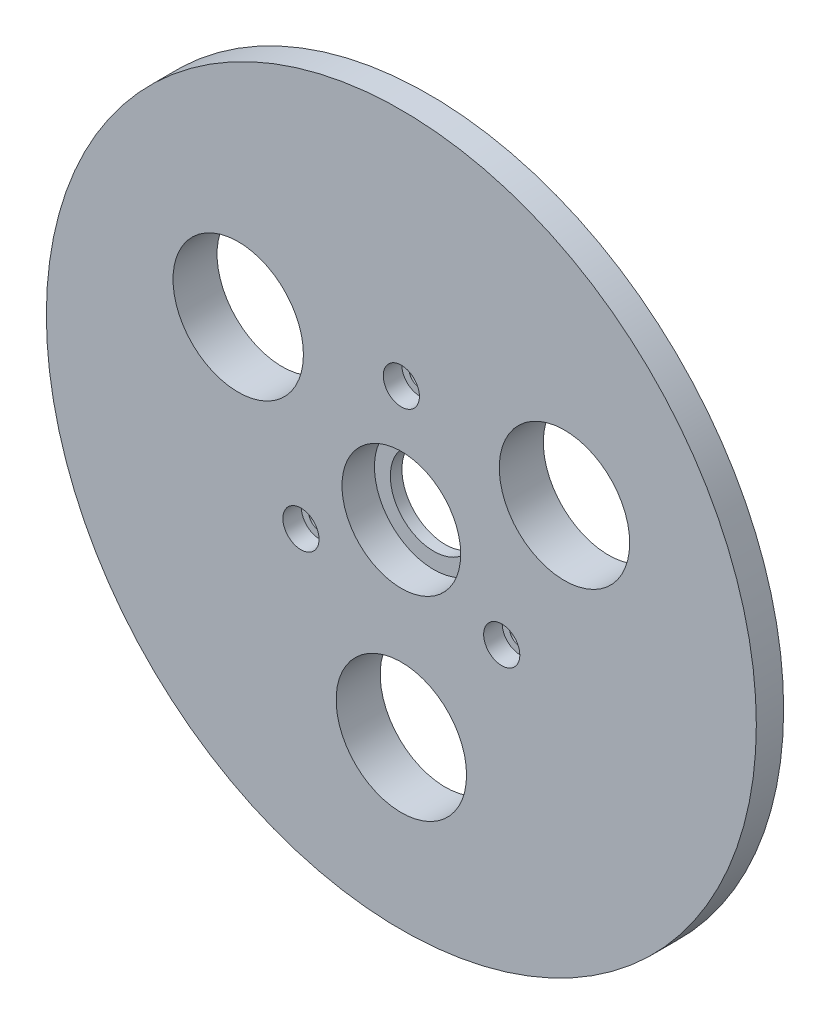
ISO-10303-21;
HEADER;
FILE_DESCRIPTION(('STEP AP214'),'2;1');
FILE_NAME('part.step','',(''),(''),'','','');
FILE_SCHEMA(('AUTOMOTIVE_DESIGN { 1 0 10303 214 1 1 1 1 }'));
ENDSEC;
DATA;
#1=APPLICATION_CONTEXT('core data for automotive mechanical design processes');
#2=APPLICATION_PROTOCOL_DEFINITION('international standard','automotive_design',2000,#1);
#3=PRODUCT_CONTEXT('',#1,'mechanical');
#4=PRODUCT('Part','Part','',(#3));
#5=PRODUCT_RELATED_PRODUCT_CATEGORY('part','',(#4));
#6=PRODUCT_DEFINITION_FORMATION('','',#4);
#7=PRODUCT_DEFINITION_CONTEXT('part definition',#1,'design');
#8=PRODUCT_DEFINITION('design','',#6,#7);
#9=PRODUCT_DEFINITION_SHAPE('','',#8);
#10=(LENGTH_UNIT() NAMED_UNIT(*) SI_UNIT(.MILLI.,.METRE.));
#11=(NAMED_UNIT(*) PLANE_ANGLE_UNIT() SI_UNIT($,.RADIAN.));
#12=(NAMED_UNIT(*) SI_UNIT($,.STERADIAN.) SOLID_ANGLE_UNIT());
#13=UNCERTAINTY_MEASURE_WITH_UNIT(LENGTH_MEASURE(1.E-05),#10,'distance_accuracy_value','');
#14=(GEOMETRIC_REPRESENTATION_CONTEXT(3) GLOBAL_UNCERTAINTY_ASSIGNED_CONTEXT((#13)) GLOBAL_UNIT_ASSIGNED_CONTEXT((#10,
#11,#12)) REPRESENTATION_CONTEXT('',''));
#15=CARTESIAN_POINT('',(0.,0.,0.));
#16=DIRECTION('',(0.,0.,1.));
#17=DIRECTION('',(1.,0.,0.));
#18=AXIS2_PLACEMENT_3D('',#15,#16,#17);
#19=CARTESIAN_POINT('',(0.,0.,9.652));
#20=DIRECTION('',(0.,0.,1.));
#21=DIRECTION('',(1.,0.,0.));
#22=AXIS2_PLACEMENT_3D('',#19,#20,#21);
#23=PLANE('',#22);
#24=CARTESIAN_POINT('',(35.7451985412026,20.6375000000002,9.652));
#25=DIRECTION('',(0.,0.,1.));
#26=DIRECTION('',(1.,0.,0.));
#27=AXIS2_PLACEMENT_3D('',#24,#25,#26);
#28=CIRCLE('',#27,14.2875);
#29=CARTESIAN_POINT('',(50.0326985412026,20.6375000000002,9.652));
#30=VERTEX_POINT('',#29);
#31=EDGE_CURVE('E102',#30,#30,#28,.F.);
#32=ORIENTED_EDGE('',*,*,#31,.T.);
#33=EDGE_LOOP('',(#32));
#34=FACE_BOUND('',#33,.T.);
#35=CARTESIAN_POINT('',(0.,0.,9.652));
#36=DIRECTION('',(0.,0.,1.));
#37=DIRECTION('',(1.,0.,0.));
#38=AXIS2_PLACEMENT_3D('',#35,#36,#37);
#39=CIRCLE('',#38,77.7875);
#40=CARTESIAN_POINT('',(77.7875,0.,9.652));
#41=VERTEX_POINT('',#40);
#42=EDGE_CURVE('E42',#41,#41,#39,.T.);
#43=ORIENTED_EDGE('',*,*,#42,.T.);
#44=EDGE_LOOP('',(#43));
#45=FACE_BOUND('',#44,.T.);
#46=CARTESIAN_POINT('',(0.,0.,9.652));
#47=DIRECTION('',(0.,0.,1.));
#48=DIRECTION('',(1.,0.,0.));
#49=AXIS2_PLACEMENT_3D('',#46,#47,#48);
#50=CIRCLE('',#49,13.0048);
#51=CARTESIAN_POINT('',(13.0048,0.,9.652));
#52=VERTEX_POINT('',#51);
#53=EDGE_CURVE('E62',#52,#52,#50,.T.);
#54=ORIENTED_EDGE('',*,*,#53,.F.);
#55=EDGE_LOOP('',(#54));
#56=FACE_BOUND('',#55,.T.);
#57=CARTESIAN_POINT('',(-21.9970452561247,-12.7000000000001,9.652));
#58=DIRECTION('',(0.,0.,1.));
#59=DIRECTION('',(1.,0.,0.));
#60=AXIS2_PLACEMENT_3D('',#57,#58,#59);
#61=CIRCLE('',#60,3.9624);
#62=CARTESIAN_POINT('',(-18.0346452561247,-12.7000000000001,9.652));
#63=VERTEX_POINT('',#62);
#64=EDGE_CURVE('E57',#63,#63,#61,.T.);
#65=ORIENTED_EDGE('',*,*,#64,.F.);
#66=EDGE_LOOP('',(#65));
#67=FACE_BOUND('',#66,.T.);
#68=CARTESIAN_POINT('',(21.9970452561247,-12.7000000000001,9.652));
#69=DIRECTION('',(0.,0.,1.));
#70=DIRECTION('',(1.,0.,0.));
#71=AXIS2_PLACEMENT_3D('',#68,#69,#70);
#72=CIRCLE('',#71,3.9624);
#73=CARTESIAN_POINT('',(25.9594452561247,-12.7000000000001,9.652));
#74=VERTEX_POINT('',#73);
#75=EDGE_CURVE('E52',#74,#74,#72,.T.);
#76=ORIENTED_EDGE('',*,*,#75,.F.);
#77=EDGE_LOOP('',(#76));
#78=FACE_BOUND('',#77,.T.);
#79=CARTESIAN_POINT('',(0.,25.4,9.652));
#80=DIRECTION('',(0.,0.,1.));
#81=DIRECTION('',(1.,0.,0.));
#82=AXIS2_PLACEMENT_3D('',#79,#80,#81);
#83=CIRCLE('',#82,3.9624);
#84=CARTESIAN_POINT('',(3.9624,25.4,9.652));
#85=VERTEX_POINT('',#84);
#86=EDGE_CURVE('E91',#85,#85,#83,.T.);
#87=ORIENTED_EDGE('',*,*,#86,.F.);
#88=EDGE_LOOP('',(#87));
#89=FACE_BOUND('',#88,.T.);
#90=CARTESIAN_POINT('',(0.,-41.275,9.652));
#91=DIRECTION('',(0.,0.,1.));
#92=DIRECTION('',(1.,0.,0.));
#93=AXIS2_PLACEMENT_3D('',#90,#91,#92);
#94=CIRCLE('',#93,14.2875);
#95=CARTESIAN_POINT('',(14.2875,-41.275,9.652));
#96=VERTEX_POINT('',#95);
#97=EDGE_CURVE('E94',#96,#96,#94,.F.);
#98=ORIENTED_EDGE('',*,*,#97,.T.);
#99=EDGE_LOOP('',(#98));
#100=FACE_BOUND('',#99,.T.);
#101=CARTESIAN_POINT('',(-35.7451985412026,20.6375000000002,9.652));
#102=DIRECTION('',(0.,0.,1.));
#103=DIRECTION('',(1.,0.,0.));
#104=AXIS2_PLACEMENT_3D('',#101,#102,#103);
#105=CIRCLE('',#104,14.2875);
#106=CARTESIAN_POINT('',(-21.4576985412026,20.6375000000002,9.652));
#107=VERTEX_POINT('',#106);
#108=EDGE_CURVE('E108',#107,#107,#105,.F.);
#109=ORIENTED_EDGE('',*,*,#108,.T.);
#110=EDGE_LOOP('',(#109));
#111=FACE_BOUND('',#110,.T.);
#112=ADVANCED_FACE('F31',(#34,#45,#56,#67,#78,#89,#100,#111),#23,.T.);
#113=CARTESIAN_POINT('',(0.,0.,0.));
#114=DIRECTION('',(0.,0.,1.));
#115=DIRECTION('',(1.,0.,0.));
#116=AXIS2_PLACEMENT_3D('',#113,#114,#115);
#117=PLANE('',#116);
#118=CARTESIAN_POINT('',(35.7451985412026,20.6375000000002,0.));
#119=DIRECTION('',(0.,0.,1.));
#120=DIRECTION('',(1.,0.,0.));
#121=AXIS2_PLACEMENT_3D('',#118,#119,#120);
#122=CIRCLE('',#121,14.2875);
#123=CARTESIAN_POINT('',(50.0326985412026,20.6375000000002,0.));
#124=VERTEX_POINT('',#123);
#125=EDGE_CURVE('E105',#124,#124,#122,.T.);
#126=ORIENTED_EDGE('',*,*,#125,.T.);
#127=EDGE_LOOP('',(#126));
#128=FACE_BOUND('',#127,.T.);
#129=CARTESIAN_POINT('',(0.,25.4,0.));
#130=DIRECTION('',(0.,0.,1.));
#131=DIRECTION('',(1.,0.,0.));
#132=AXIS2_PLACEMENT_3D('',#129,#130,#131);
#133=CIRCLE('',#132,2.3876);
#134=CARTESIAN_POINT('',(2.3876,25.4,0.));
#135=VERTEX_POINT('',#134);
#136=EDGE_CURVE('E66',#135,#135,#133,.T.);
#137=ORIENTED_EDGE('',*,*,#136,.T.);
#138=EDGE_LOOP('',(#137));
#139=FACE_BOUND('',#138,.T.);
#140=CARTESIAN_POINT('',(-21.9970452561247,-12.7000000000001,0.));
#141=DIRECTION('',(0.,0.,1.));
#142=DIRECTION('',(1.,0.,0.));
#143=AXIS2_PLACEMENT_3D('',#140,#141,#142);
#144=CIRCLE('',#143,2.38760000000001);
#145=CARTESIAN_POINT('',(-19.6094452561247,-12.7000000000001,0.));
#146=VERTEX_POINT('',#145);
#147=EDGE_CURVE('E71',#146,#146,#144,.T.);
#148=ORIENTED_EDGE('',*,*,#147,.T.);
#149=EDGE_LOOP('',(#148));
#150=FACE_BOUND('',#149,.T.);
#151=CARTESIAN_POINT('',(0.,0.,0.));
#152=DIRECTION('',(0.,0.,1.));
#153=DIRECTION('',(1.,0.,0.));
#154=AXIS2_PLACEMENT_3D('',#151,#152,#153);
#155=CIRCLE('',#154,9.525);
#156=CARTESIAN_POINT('',(9.525,0.,0.));
#157=VERTEX_POINT('',#156);
#158=EDGE_CURVE('E46',#157,#157,#155,.T.);
#159=ORIENTED_EDGE('',*,*,#158,.T.);
#160=EDGE_LOOP('',(#159));
#161=FACE_BOUND('',#160,.T.);
#162=CARTESIAN_POINT('',(21.9970452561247,-12.7000000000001,0.));
#163=DIRECTION('',(0.,0.,1.));
#164=DIRECTION('',(1.,0.,0.));
#165=AXIS2_PLACEMENT_3D('',#162,#163,#164);
#166=CIRCLE('',#165,2.38760000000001);
#167=CARTESIAN_POINT('',(24.3846452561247,-12.7000000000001,0.));
#168=VERTEX_POINT('',#167);
#169=EDGE_CURVE('E74',#168,#168,#166,.T.);
#170=ORIENTED_EDGE('',*,*,#169,.T.);
#171=EDGE_LOOP('',(#170));
#172=FACE_BOUND('',#171,.T.);
#173=CARTESIAN_POINT('',(0.,0.,0.));
#174=DIRECTION('',(0.,0.,1.));
#175=DIRECTION('',(1.,0.,0.));
#176=AXIS2_PLACEMENT_3D('',#173,#174,#175);
#177=CIRCLE('',#176,71.4375);
#178=CARTESIAN_POINT('',(71.4375,0.,0.));
#179=VERTEX_POINT('',#178);
#180=EDGE_CURVE('E10',#179,#179,#177,.F.);
#181=ORIENTED_EDGE('',*,*,#180,.T.);
#182=EDGE_LOOP('',(#181));
#183=FACE_BOUND('',#182,.T.);
#184=CARTESIAN_POINT('',(0.,-41.275,0.));
#185=DIRECTION('',(0.,0.,1.));
#186=DIRECTION('',(1.,0.,0.));
#187=AXIS2_PLACEMENT_3D('',#184,#185,#186);
#188=CIRCLE('',#187,14.2875);
#189=CARTESIAN_POINT('',(14.2875,-41.275,0.));
#190=VERTEX_POINT('',#189);
#191=EDGE_CURVE('E99',#190,#190,#188,.T.);
#192=ORIENTED_EDGE('',*,*,#191,.T.);
#193=EDGE_LOOP('',(#192));
#194=FACE_BOUND('',#193,.T.);
#195=CARTESIAN_POINT('',(-35.7451985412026,20.6375000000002,0.));
#196=DIRECTION('',(0.,0.,1.));
#197=DIRECTION('',(1.,0.,0.));
#198=AXIS2_PLACEMENT_3D('',#195,#196,#197);
#199=CIRCLE('',#198,14.2875);
#200=CARTESIAN_POINT('',(-21.4576985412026,20.6375000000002,0.));
#201=VERTEX_POINT('',#200);
#202=EDGE_CURVE('E111',#201,#201,#199,.T.);
#203=ORIENTED_EDGE('',*,*,#202,.T.);
#204=EDGE_LOOP('',(#203));
#205=FACE_BOUND('',#204,.T.);
#206=ADVANCED_FACE('F115',(#128,#139,#150,#161,#172,#183,#194,#205),#117,.F.);
#207=CARTESIAN_POINT('',(0.,25.4,9.652));
#208=DIRECTION('',(0.,0.,-1.));
#209=DIRECTION('',(-1.,0.,0.));
#210=AXIS2_PLACEMENT_3D('',#207,#208,#209);
#211=CYLINDRICAL_SURFACE('',#210,2.3876);
#212=ORIENTED_EDGE('',*,*,#136,.F.);
#213=EDGE_LOOP('',(#212));
#214=FACE_BOUND('',#213,.T.);
#215=CARTESIAN_POINT('',(0.,25.4,5.588));
#216=DIRECTION('',(0.,0.,1.));
#217=DIRECTION('',(1.,0.,0.));
#218=AXIS2_PLACEMENT_3D('',#215,#216,#217);
#219=CIRCLE('',#218,2.3876);
#220=CARTESIAN_POINT('',(2.3876,25.4,5.588));
#221=VERTEX_POINT('',#220);
#222=EDGE_CURVE('E49',#221,#221,#219,.T.);
#223=ORIENTED_EDGE('',*,*,#222,.T.);
#224=EDGE_LOOP('',(#223));
#225=FACE_BOUND('',#224,.T.);
#226=ADVANCED_FACE('F136',(#214,#225),#211,.F.);
#227=CARTESIAN_POINT('',(21.9970452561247,-12.7000000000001,9.652));
#228=DIRECTION('',(0.,0.,-1.));
#229=DIRECTION('',(-1.,0.,0.));
#230=AXIS2_PLACEMENT_3D('',#227,#228,#229);
#231=CYLINDRICAL_SURFACE('',#230,2.38760000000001);
#232=ORIENTED_EDGE('',*,*,#169,.F.);
#233=EDGE_LOOP('',(#232));
#234=FACE_BOUND('',#233,.T.);
#235=CARTESIAN_POINT('',(21.9970452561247,-12.7000000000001,5.588));
#236=DIRECTION('',(0.,0.,1.));
#237=DIRECTION('',(1.,0.,0.));
#238=AXIS2_PLACEMENT_3D('',#235,#236,#237);
#239=CIRCLE('',#238,2.38760000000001);
#240=CARTESIAN_POINT('',(24.3846452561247,-12.7000000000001,5.588));
#241=VERTEX_POINT('',#240);
#242=EDGE_CURVE('E54',#241,#241,#239,.T.);
#243=ORIENTED_EDGE('',*,*,#242,.T.);
#244=EDGE_LOOP('',(#243));
#245=FACE_BOUND('',#244,.T.);
#246=ADVANCED_FACE('F209',(#234,#245),#231,.F.);
#247=CARTESIAN_POINT('',(-21.9970452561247,-12.7000000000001,9.652));
#248=DIRECTION('',(0.,0.,-1.));
#249=DIRECTION('',(-1.,0.,0.));
#250=AXIS2_PLACEMENT_3D('',#247,#248,#249);
#251=CYLINDRICAL_SURFACE('',#250,2.38760000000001);
#252=ORIENTED_EDGE('',*,*,#147,.F.);
#253=EDGE_LOOP('',(#252));
#254=FACE_BOUND('',#253,.T.);
#255=CARTESIAN_POINT('',(-21.9970452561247,-12.7000000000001,5.588));
#256=DIRECTION('',(0.,0.,1.));
#257=DIRECTION('',(1.,0.,0.));
#258=AXIS2_PLACEMENT_3D('',#255,#256,#257);
#259=CIRCLE('',#258,2.38760000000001);
#260=CARTESIAN_POINT('',(-19.6094452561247,-12.7000000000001,5.588));
#261=VERTEX_POINT('',#260);
#262=EDGE_CURVE('E59',#261,#261,#259,.T.);
#263=ORIENTED_EDGE('',*,*,#262,.T.);
#264=EDGE_LOOP('',(#263));
#265=FACE_BOUND('',#264,.T.);
#266=ADVANCED_FACE('F153',(#254,#265),#251,.F.);
#267=CARTESIAN_POINT('',(0.,0.,9.652));
#268=DIRECTION('',(0.,0.,-1.));
#269=DIRECTION('',(-1.,0.,0.));
#270=AXIS2_PLACEMENT_3D('',#267,#268,#269);
#271=CYLINDRICAL_SURFACE('',#270,9.525);
#272=ORIENTED_EDGE('',*,*,#158,.F.);
#273=EDGE_LOOP('',(#272));
#274=FACE_BOUND('',#273,.T.);
#275=CARTESIAN_POINT('',(0.,0.,2.54));
#276=DIRECTION('',(0.,0.,1.));
#277=DIRECTION('',(1.,0.,0.));
#278=AXIS2_PLACEMENT_3D('',#275,#276,#277);
#279=CIRCLE('',#278,9.525);
#280=CARTESIAN_POINT('',(9.525,0.,2.54));
#281=VERTEX_POINT('',#280);
#282=EDGE_CURVE('E64',#281,#281,#279,.T.);
#283=ORIENTED_EDGE('',*,*,#282,.T.);
#284=EDGE_LOOP('',(#283));
#285=FACE_BOUND('',#284,.T.);
#286=ADVANCED_FACE('F141',(#274,#285),#271,.F.);
#287=CARTESIAN_POINT('',(0.,0.,9.652));
#288=DIRECTION('',(0.,0.,-1.));
#289=DIRECTION('',(-1.,0.,0.));
#290=AXIS2_PLACEMENT_3D('',#287,#288,#289);
#291=CYLINDRICAL_SURFACE('',#290,77.7875);
#292=CARTESIAN_POINT('',(0.,0.,3.66617420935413));
#293=DIRECTION('',(0.,0.,1.));
#294=DIRECTION('',(1.,0.,0.));
#295=AXIS2_PLACEMENT_3D('',#292,#293,#294);
#296=CIRCLE('',#295,77.7875);
#297=CARTESIAN_POINT('',(77.7875,0.,3.66617420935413));
#298=VERTEX_POINT('',#297);
#299=EDGE_CURVE('E38',#298,#298,#296,.T.);
#300=ORIENTED_EDGE('',*,*,#299,.T.);
#301=EDGE_LOOP('',(#300));
#302=FACE_BOUND('',#301,.T.);
#303=ORIENTED_EDGE('',*,*,#42,.F.);
#304=EDGE_LOOP('',(#303));
#305=FACE_BOUND('',#304,.T.);
#306=ADVANCED_FACE('F143',(#302,#305),#291,.T.);
#307=CARTESIAN_POINT('',(0.,0.,2.54));
#308=DIRECTION('',(0.,0.,1.));
#309=DIRECTION('',(1.,0.,0.));
#310=AXIS2_PLACEMENT_3D('',#307,#308,#309);
#311=CYLINDRICAL_SURFACE('',#310,13.0048);
#312=CARTESIAN_POINT('',(0.,0.,2.54));
#313=DIRECTION('',(0.,0.,1.));
#314=DIRECTION('',(1.,0.,0.));
#315=AXIS2_PLACEMENT_3D('',#312,#313,#314);
#316=CIRCLE('',#315,13.0048);
#317=CARTESIAN_POINT('',(13.0048,0.,2.54));
#318=VERTEX_POINT('',#317);
#319=EDGE_CURVE('E67',#318,#318,#316,.T.);
#320=ORIENTED_EDGE('',*,*,#319,.F.);
#321=EDGE_LOOP('',(#320));
#322=FACE_BOUND('',#321,.T.);
#323=ORIENTED_EDGE('',*,*,#53,.T.);
#324=EDGE_LOOP('',(#323));
#325=FACE_BOUND('',#324,.T.);
#326=ADVANCED_FACE('F145',(#322,#325),#311,.F.);
#327=CARTESIAN_POINT('',(0.,0.,2.54));
#328=DIRECTION('',(0.,0.,1.));
#329=DIRECTION('',(1.,0.,0.));
#330=AXIS2_PLACEMENT_3D('',#327,#328,#329);
#331=PLANE('',#330);
#332=ORIENTED_EDGE('',*,*,#282,.F.);
#333=EDGE_LOOP('',(#332));
#334=FACE_BOUND('',#333,.T.);
#335=ORIENTED_EDGE('',*,*,#319,.T.);
#336=EDGE_LOOP('',(#335));
#337=FACE_BOUND('',#336,.T.);
#338=ADVANCED_FACE('F150',(#334,#337),#331,.T.);
#339=CARTESIAN_POINT('',(-21.9970452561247,-12.7000000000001,5.588));
#340=DIRECTION('',(0.,0.,1.));
#341=DIRECTION('',(1.,0.,0.));
#342=AXIS2_PLACEMENT_3D('',#339,#340,#341);
#343=CYLINDRICAL_SURFACE('',#342,3.9624);
#344=CARTESIAN_POINT('',(-21.9970452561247,-12.7000000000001,5.588));
#345=DIRECTION('',(0.,0.,1.));
#346=DIRECTION('',(1.,0.,0.));
#347=AXIS2_PLACEMENT_3D('',#344,#345,#346);
#348=CIRCLE('',#347,3.9624);
#349=CARTESIAN_POINT('',(-18.0346452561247,-12.7000000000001,5.588));
#350=VERTEX_POINT('',#349);
#351=EDGE_CURVE('E63',#350,#350,#348,.T.);
#352=ORIENTED_EDGE('',*,*,#351,.F.);
#353=EDGE_LOOP('',(#352));
#354=FACE_BOUND('',#353,.T.);
#355=ORIENTED_EDGE('',*,*,#64,.T.);
#356=EDGE_LOOP('',(#355));
#357=FACE_BOUND('',#356,.T.);
#358=ADVANCED_FACE('F199',(#354,#357),#343,.F.);
#359=CARTESIAN_POINT('',(-21.9970452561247,-12.7000000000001,5.588));
#360=DIRECTION('',(0.,0.,1.));
#361=DIRECTION('',(1.,0.,0.));
#362=AXIS2_PLACEMENT_3D('',#359,#360,#361);
#363=PLANE('',#362);
#364=ORIENTED_EDGE('',*,*,#262,.F.);
#365=EDGE_LOOP('',(#364));
#366=FACE_BOUND('',#365,.T.);
#367=ORIENTED_EDGE('',*,*,#351,.T.);
#368=EDGE_LOOP('',(#367));
#369=FACE_BOUND('',#368,.T.);
#370=ADVANCED_FACE('F195',(#366,#369),#363,.T.);
#371=CARTESIAN_POINT('',(21.9970452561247,-12.7000000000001,5.588));
#372=DIRECTION('',(0.,0.,1.));
#373=DIRECTION('',(1.,0.,0.));
#374=AXIS2_PLACEMENT_3D('',#371,#372,#373);
#375=CYLINDRICAL_SURFACE('',#374,3.9624);
#376=CARTESIAN_POINT('',(21.9970452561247,-12.7000000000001,5.588));
#377=DIRECTION('',(0.,0.,1.));
#378=DIRECTION('',(1.,0.,0.));
#379=AXIS2_PLACEMENT_3D('',#376,#377,#378);
#380=CIRCLE('',#379,3.9624);
#381=CARTESIAN_POINT('',(25.9594452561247,-12.7000000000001,5.588));
#382=VERTEX_POINT('',#381);
#383=EDGE_CURVE('E58',#382,#382,#380,.T.);
#384=ORIENTED_EDGE('',*,*,#383,.F.);
#385=EDGE_LOOP('',(#384));
#386=FACE_BOUND('',#385,.T.);
#387=ORIENTED_EDGE('',*,*,#75,.T.);
#388=EDGE_LOOP('',(#387));
#389=FACE_BOUND('',#388,.T.);
#390=ADVANCED_FACE('F191',(#386,#389),#375,.F.);
#391=CARTESIAN_POINT('',(21.9970452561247,-12.7000000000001,5.588));
#392=DIRECTION('',(0.,0.,1.));
#393=DIRECTION('',(1.,0.,0.));
#394=AXIS2_PLACEMENT_3D('',#391,#392,#393);
#395=PLANE('',#394);
#396=ORIENTED_EDGE('',*,*,#242,.F.);
#397=EDGE_LOOP('',(#396));
#398=FACE_BOUND('',#397,.T.);
#399=ORIENTED_EDGE('',*,*,#383,.T.);
#400=EDGE_LOOP('',(#399));
#401=FACE_BOUND('',#400,.T.);
#402=ADVANCED_FACE('F187',(#398,#401),#395,.T.);
#403=CARTESIAN_POINT('',(0.,25.4,5.588));
#404=DIRECTION('',(0.,0.,1.));
#405=DIRECTION('',(1.,0.,0.));
#406=AXIS2_PLACEMENT_3D('',#403,#404,#405);
#407=CYLINDRICAL_SURFACE('',#406,3.9624);
#408=CARTESIAN_POINT('',(0.,25.4,5.588));
#409=DIRECTION('',(0.,0.,1.));
#410=DIRECTION('',(1.,0.,0.));
#411=AXIS2_PLACEMENT_3D('',#408,#409,#410);
#412=CIRCLE('',#411,3.9624);
#413=CARTESIAN_POINT('',(3.9624,25.4,5.588));
#414=VERTEX_POINT('',#413);
#415=EDGE_CURVE('E53',#414,#414,#412,.T.);
#416=ORIENTED_EDGE('',*,*,#415,.F.);
#417=EDGE_LOOP('',(#416));
#418=FACE_BOUND('',#417,.T.);
#419=ORIENTED_EDGE('',*,*,#86,.T.);
#420=EDGE_LOOP('',(#419));
#421=FACE_BOUND('',#420,.T.);
#422=ADVANCED_FACE('F183',(#418,#421),#407,.F.);
#423=CARTESIAN_POINT('',(0.,25.4,5.588));
#424=DIRECTION('',(0.,0.,1.));
#425=DIRECTION('',(1.,0.,0.));
#426=AXIS2_PLACEMENT_3D('',#423,#424,#425);
#427=PLANE('',#426);
#428=ORIENTED_EDGE('',*,*,#222,.F.);
#429=EDGE_LOOP('',(#428));
#430=FACE_BOUND('',#429,.T.);
#431=ORIENTED_EDGE('',*,*,#415,.T.);
#432=EDGE_LOOP('',(#431));
#433=FACE_BOUND('',#432,.T.);
#434=ADVANCED_FACE('F178',(#430,#433),#427,.T.);
#435=CARTESIAN_POINT('',(0.,0.,3.66617420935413));
#436=DIRECTION('',(0.,0.,1.));
#437=DIRECTION('',(1.,0.,0.));
#438=AXIS2_PLACEMENT_3D('',#435,#436,#437);
#439=CONICAL_SURFACE('',#438,77.7875,1.0471975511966);
#440=ORIENTED_EDGE('',*,*,#180,.F.);
#441=EDGE_LOOP('',(#440));
#442=FACE_BOUND('',#441,.T.);
#443=ORIENTED_EDGE('',*,*,#299,.F.);
#444=EDGE_LOOP('',(#443));
#445=FACE_BOUND('',#444,.T.);
#446=ADVANCED_FACE('F33',(#442,#445),#439,.T.);
#447=CARTESIAN_POINT('',(0.,-41.275,25.4));
#448=DIRECTION('',(0.,0.,-1.));
#449=DIRECTION('',(-1.,0.,0.));
#450=AXIS2_PLACEMENT_3D('',#447,#448,#449);
#451=CYLINDRICAL_SURFACE('',#450,14.2875);
#452=ORIENTED_EDGE('',*,*,#97,.F.);
#453=EDGE_LOOP('',(#452));
#454=FACE_BOUND('',#453,.T.);
#455=ORIENTED_EDGE('',*,*,#191,.F.);
#456=EDGE_LOOP('',(#455));
#457=FACE_BOUND('',#456,.T.);
#458=ADVANCED_FACE('F125',(#454,#457),#451,.F.);
#459=CARTESIAN_POINT('',(35.7451985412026,20.6375000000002,25.4));
#460=DIRECTION('',(0.,0.,-1.));
#461=DIRECTION('',(-1.,0.,0.));
#462=AXIS2_PLACEMENT_3D('',#459,#460,#461);
#463=CYLINDRICAL_SURFACE('',#462,14.2875);
#464=ORIENTED_EDGE('',*,*,#31,.F.);
#465=EDGE_LOOP('',(#464));
#466=FACE_BOUND('',#465,.T.);
#467=ORIENTED_EDGE('',*,*,#125,.F.);
#468=EDGE_LOOP('',(#467));
#469=FACE_BOUND('',#468,.T.);
#470=ADVANCED_FACE('F119',(#466,#469),#463,.F.);
#471=CARTESIAN_POINT('',(-35.7451985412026,20.6375000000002,25.4));
#472=DIRECTION('',(0.,0.,-1.));
#473=DIRECTION('',(-1.,0.,0.));
#474=AXIS2_PLACEMENT_3D('',#471,#472,#473);
#475=CYLINDRICAL_SURFACE('',#474,14.2875);
#476=ORIENTED_EDGE('',*,*,#108,.F.);
#477=EDGE_LOOP('',(#476));
#478=FACE_BOUND('',#477,.T.);
#479=ORIENTED_EDGE('',*,*,#202,.F.);
#480=EDGE_LOOP('',(#479));
#481=FACE_BOUND('',#480,.T.);
#482=ADVANCED_FACE('F117',(#478,#481),#475,.F.);
#483=CLOSED_SHELL('',(#112,#206,#226,#246,#266,#286,#306,#326,#338,#358,#370,#390,#402,#422,
#434,#446,#458,#470,#482));
#484=MANIFOLD_SOLID_BREP('B2',#483);
#485=ADVANCED_BREP_SHAPE_REPRESENTATION('',(#18,#484),#14);
#486=SHAPE_DEFINITION_REPRESENTATION(#9,#485);
ENDSEC;
END-ISO-10303-21;
